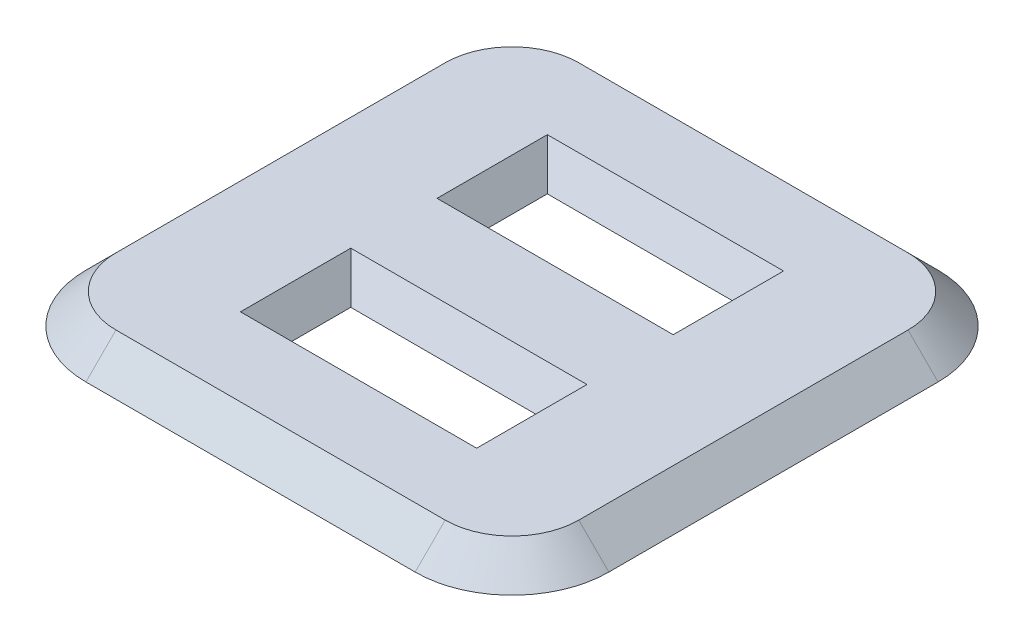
ISO-10303-21;
HEADER;
FILE_DESCRIPTION(('STEP AP214'),'2;1');
FILE_NAME('part.step','',(''),(''),'','','');
FILE_SCHEMA(('AUTOMOTIVE_DESIGN { 1 0 10303 214 1 1 1 1 }'));
ENDSEC;
DATA;
#1=APPLICATION_CONTEXT('core data for automotive mechanical design processes');
#2=APPLICATION_PROTOCOL_DEFINITION('international standard','automotive_design',2000,#1);
#3=PRODUCT_CONTEXT('',#1,'mechanical');
#4=PRODUCT('Part','Part','',(#3));
#5=PRODUCT_RELATED_PRODUCT_CATEGORY('part','',(#4));
#6=PRODUCT_DEFINITION_FORMATION('','',#4);
#7=PRODUCT_DEFINITION_CONTEXT('part definition',#1,'design');
#8=PRODUCT_DEFINITION('design','',#6,#7);
#9=PRODUCT_DEFINITION_SHAPE('','',#8);
#10=(LENGTH_UNIT() NAMED_UNIT(*) SI_UNIT(.MILLI.,.METRE.));
#11=(NAMED_UNIT(*) PLANE_ANGLE_UNIT() SI_UNIT($,.RADIAN.));
#12=(NAMED_UNIT(*) SI_UNIT($,.STERADIAN.) SOLID_ANGLE_UNIT());
#13=UNCERTAINTY_MEASURE_WITH_UNIT(LENGTH_MEASURE(1.E-05),#10,'distance_accuracy_value','');
#14=(GEOMETRIC_REPRESENTATION_CONTEXT(3) GLOBAL_UNCERTAINTY_ASSIGNED_CONTEXT((#13)) GLOBAL_UNIT_ASSIGNED_CONTEXT((#10,
#11,#12)) REPRESENTATION_CONTEXT('',''));
#15=CARTESIAN_POINT('',(0.,0.,0.));
#16=DIRECTION('',(0.,0.,1.));
#17=DIRECTION('',(1.,0.,0.));
#18=AXIS2_PLACEMENT_3D('',#15,#16,#17);
#19=CARTESIAN_POINT('',(0.,0.31,0.));
#20=DIRECTION('',(0.,-1.,0.));
#21=DIRECTION('',(0.,0.,-1.));
#22=AXIS2_PLACEMENT_3D('',#19,#20,#21);
#23=PLANE('',#22);
#24=DIRECTION('',(-1.,0.,0.));
#25=VECTOR('',#24,1.);
#26=CARTESIAN_POINT('',(0.,0.31,1.58449223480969));
#27=LINE('',#26,#25);
#28=CARTESIAN_POINT('',(1.21949223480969,0.31,1.58449223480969));
#29=VERTEX_POINT('',#28);
#30=CARTESIAN_POINT('',(-1.21949223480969,0.31,1.58449223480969));
#31=VERTEX_POINT('',#30);
#32=EDGE_CURVE('E49',#29,#31,#27,.T.);
#33=ORIENTED_EDGE('',*,*,#32,.T.);
#34=DIRECTION('',(0.,0.,-1.));
#35=VECTOR('',#34,1.);
#36=CARTESIAN_POINT('',(-1.21949223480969,0.31,0.));
#37=LINE('',#36,#35);
#38=CARTESIAN_POINT('',(-1.21949223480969,0.31,0.445507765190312));
#39=VERTEX_POINT('',#38);
#40=EDGE_CURVE('E11',#31,#39,#37,.T.);
#41=ORIENTED_EDGE('',*,*,#40,.T.);
#42=DIRECTION('',(1.,0.,0.));
#43=VECTOR('',#42,1.);
#44=CARTESIAN_POINT('',(0.,0.31,0.445507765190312));
#45=LINE('',#44,#43);
#46=CARTESIAN_POINT('',(1.21949223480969,0.31,0.445507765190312));
#47=VERTEX_POINT('',#46);
#48=EDGE_CURVE('E260',#39,#47,#45,.T.);
#49=ORIENTED_EDGE('',*,*,#48,.T.);
#50=DIRECTION('',(0.,0.,1.));
#51=VECTOR('',#50,1.);
#52=CARTESIAN_POINT('',(1.21949223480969,0.31,0.));
#53=LINE('',#52,#51);
#54=EDGE_CURVE('E60',#47,#29,#53,.T.);
#55=ORIENTED_EDGE('',*,*,#54,.T.);
#56=EDGE_LOOP('',(#33,#41,#49,#55));
#57=FACE_BOUND('',#56,.T.);
#58=DIRECTION('',(0.,0.,1.));
#59=VECTOR('',#58,1.);
#60=CARTESIAN_POINT('',(1.21949223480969,0.31,0.));
#61=LINE('',#60,#59);
#62=CARTESIAN_POINT('',(1.21949223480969,0.31,-1.58449223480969));
#63=VERTEX_POINT('',#62);
#64=CARTESIAN_POINT('',(1.21949223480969,0.31,-0.445507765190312));
#65=VERTEX_POINT('',#64);
#66=EDGE_CURVE('E256',#63,#65,#61,.T.);
#67=ORIENTED_EDGE('',*,*,#66,.T.);
#68=DIRECTION('',(-1.,0.,0.));
#69=VECTOR('',#68,1.);
#70=CARTESIAN_POINT('',(0.,0.31,-0.445507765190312));
#71=LINE('',#70,#69);
#72=CARTESIAN_POINT('',(-1.21949223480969,0.31,-0.445507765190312));
#73=VERTEX_POINT('',#72);
#74=EDGE_CURVE('E258',#65,#73,#71,.T.);
#75=ORIENTED_EDGE('',*,*,#74,.T.);
#76=DIRECTION('',(0.,0.,-1.));
#77=VECTOR('',#76,1.);
#78=CARTESIAN_POINT('',(-1.21949223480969,0.31,0.));
#79=LINE('',#78,#77);
#80=CARTESIAN_POINT('',(-1.21949223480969,0.31,-1.58449223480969));
#81=VERTEX_POINT('',#80);
#82=EDGE_CURVE('E169',#73,#81,#79,.T.);
#83=ORIENTED_EDGE('',*,*,#82,.T.);
#84=DIRECTION('',(1.,0.,0.));
#85=VECTOR('',#84,1.);
#86=CARTESIAN_POINT('',(0.,0.31,-1.58449223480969));
#87=LINE('',#86,#85);
#88=EDGE_CURVE('E233',#81,#63,#87,.T.);
#89=ORIENTED_EDGE('',*,*,#88,.T.);
#90=EDGE_LOOP('',(#67,#75,#83,#89));
#91=FACE_BOUND('',#90,.T.);
#92=DIRECTION('',(1.,0.,0.));
#93=VECTOR('',#92,1.);
#94=CARTESIAN_POINT('',(0.,0.31,2.39));
#95=LINE('',#94,#93);
#96=CARTESIAN_POINT('',(-1.7,0.31,2.39));
#97=VERTEX_POINT('',#96);
#98=CARTESIAN_POINT('',(1.7,0.31,2.39));
#99=VERTEX_POINT('',#98);
#100=EDGE_CURVE('E228',#97,#99,#95,.T.);
#101=ORIENTED_EDGE('',*,*,#100,.T.);
#102=CARTESIAN_POINT('',(1.7,0.31,1.7));
#103=DIRECTION('',(0.,-1.,0.));
#104=DIRECTION('',(0.,0.,-1.));
#105=AXIS2_PLACEMENT_3D('',#102,#103,#104);
#106=CIRCLE('',#105,0.69);
#107=CARTESIAN_POINT('',(2.39,0.31,1.7));
#108=VERTEX_POINT('',#107);
#109=EDGE_CURVE('E230',#99,#108,#106,.F.);
#110=ORIENTED_EDGE('',*,*,#109,.T.);
#111=DIRECTION('',(0.,0.,-1.));
#112=VECTOR('',#111,1.);
#113=CARTESIAN_POINT('',(2.39,0.31,0.));
#114=LINE('',#113,#112);
#115=CARTESIAN_POINT('',(2.39,0.31,-1.7));
#116=VERTEX_POINT('',#115);
#117=EDGE_CURVE('E216',#108,#116,#114,.T.);
#118=ORIENTED_EDGE('',*,*,#117,.T.);
#119=CARTESIAN_POINT('',(1.7,0.31,-1.7));
#120=DIRECTION('',(0.,-1.,0.));
#121=DIRECTION('',(0.,0.,-1.));
#122=AXIS2_PLACEMENT_3D('',#119,#120,#121);
#123=CIRCLE('',#122,0.69);
#124=CARTESIAN_POINT('',(1.7,0.31,-2.39));
#125=VERTEX_POINT('',#124);
#126=EDGE_CURVE('E218',#116,#125,#123,.F.);
#127=ORIENTED_EDGE('',*,*,#126,.T.);
#128=DIRECTION('',(-1.,0.,0.));
#129=VECTOR('',#128,1.);
#130=CARTESIAN_POINT('',(0.,0.31,-2.39));
#131=LINE('',#130,#129);
#132=CARTESIAN_POINT('',(-1.7,0.31,-2.39));
#133=VERTEX_POINT('',#132);
#134=EDGE_CURVE('E220',#125,#133,#131,.T.);
#135=ORIENTED_EDGE('',*,*,#134,.T.);
#136=CARTESIAN_POINT('',(-1.7,0.31,-1.7));
#137=DIRECTION('',(0.,-1.,0.));
#138=DIRECTION('',(0.,0.,-1.));
#139=AXIS2_PLACEMENT_3D('',#136,#137,#138);
#140=CIRCLE('',#139,0.69);
#141=CARTESIAN_POINT('',(-2.39,0.31,-1.7));
#142=VERTEX_POINT('',#141);
#143=EDGE_CURVE('E222',#133,#142,#140,.F.);
#144=ORIENTED_EDGE('',*,*,#143,.T.);
#145=DIRECTION('',(0.,0.,1.));
#146=VECTOR('',#145,1.);
#147=CARTESIAN_POINT('',(-2.39,0.31,0.));
#148=LINE('',#147,#146);
#149=CARTESIAN_POINT('',(-2.39,0.31,1.7));
#150=VERTEX_POINT('',#149);
#151=EDGE_CURVE('E224',#142,#150,#148,.T.);
#152=ORIENTED_EDGE('',*,*,#151,.T.);
#153=CARTESIAN_POINT('',(-1.7,0.31,1.7));
#154=DIRECTION('',(0.,-1.,0.));
#155=DIRECTION('',(0.,0.,-1.));
#156=AXIS2_PLACEMENT_3D('',#153,#154,#155);
#157=CIRCLE('',#156,0.69);
#158=EDGE_CURVE('E226',#150,#97,#157,.F.);
#159=ORIENTED_EDGE('',*,*,#158,.T.);
#160=EDGE_LOOP('',(#101,#110,#118,#127,#135,#144,#152,#159));
#161=FACE_BOUND('',#160,.T.);
#162=ADVANCED_FACE('F39',(#57,#91,#161),#23,.F.);
#163=CARTESIAN_POINT('',(0.,0.,0.));
#164=DIRECTION('',(0.,-1.,0.));
#165=DIRECTION('',(0.,0.,-1.));
#166=AXIS2_PLACEMENT_3D('',#163,#164,#165);
#167=PLANE('',#166);
#168=DIRECTION('',(0.,0.,1.));
#169=VECTOR('',#168,1.);
#170=CARTESIAN_POINT('',(-1.,0.,-1.365));
#171=LINE('',#170,#169);
#172=CARTESIAN_POINT('',(-1.,0.,-1.365));
#173=VERTEX_POINT('',#172);
#174=CARTESIAN_POINT('',(-1.,0.,-0.664999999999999));
#175=VERTEX_POINT('',#174);
#176=EDGE_CURVE('E153',#173,#175,#171,.T.);
#177=ORIENTED_EDGE('',*,*,#176,.T.);
#178=DIRECTION('',(1.,0.,0.));
#179=VECTOR('',#178,1.);
#180=CARTESIAN_POINT('',(1.,0.,-0.664999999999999));
#181=LINE('',#180,#179);
#182=CARTESIAN_POINT('',(1.,0.,-0.664999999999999));
#183=VERTEX_POINT('',#182);
#184=EDGE_CURVE('E158',#175,#183,#181,.T.);
#185=ORIENTED_EDGE('',*,*,#184,.T.);
#186=DIRECTION('',(0.,0.,-1.));
#187=VECTOR('',#186,1.);
#188=CARTESIAN_POINT('',(1.,0.,-1.365));
#189=LINE('',#188,#187);
#190=CARTESIAN_POINT('',(1.,0.,-1.365));
#191=VERTEX_POINT('',#190);
#192=EDGE_CURVE('E179',#183,#191,#189,.T.);
#193=ORIENTED_EDGE('',*,*,#192,.T.);
#194=DIRECTION('',(-1.,0.,0.));
#195=VECTOR('',#194,1.);
#196=CARTESIAN_POINT('',(1.,0.,-1.365));
#197=LINE('',#196,#195);
#198=EDGE_CURVE('E160',#191,#173,#197,.T.);
#199=ORIENTED_EDGE('',*,*,#198,.T.);
#200=EDGE_LOOP('',(#177,#185,#193,#199));
#201=FACE_BOUND('',#200,.T.);
#202=DIRECTION('',(0.,0.,-1.));
#203=VECTOR('',#202,1.);
#204=CARTESIAN_POINT('',(1.,0.,1.365));
#205=LINE('',#204,#203);
#206=CARTESIAN_POINT('',(1.,0.,1.365));
#207=VERTEX_POINT('',#206);
#208=CARTESIAN_POINT('',(1.,0.,0.664999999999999));
#209=VERTEX_POINT('',#208);
#210=EDGE_CURVE('E164',#207,#209,#205,.T.);
#211=ORIENTED_EDGE('',*,*,#210,.T.);
#212=DIRECTION('',(-1.,0.,0.));
#213=VECTOR('',#212,1.);
#214=CARTESIAN_POINT('',(1.,0.,0.664999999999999));
#215=LINE('',#214,#213);
#216=CARTESIAN_POINT('',(-1.,0.,0.664999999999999));
#217=VERTEX_POINT('',#216);
#218=EDGE_CURVE('E191',#209,#217,#215,.T.);
#219=ORIENTED_EDGE('',*,*,#218,.T.);
#220=DIRECTION('',(0.,0.,1.));
#221=VECTOR('',#220,1.);
#222=CARTESIAN_POINT('',(-1.,0.,1.365));
#223=LINE('',#222,#221);
#224=CARTESIAN_POINT('',(-1.,0.,1.365));
#225=VERTEX_POINT('',#224);
#226=EDGE_CURVE('E187',#217,#225,#223,.T.);
#227=ORIENTED_EDGE('',*,*,#226,.T.);
#228=DIRECTION('',(1.,0.,0.));
#229=VECTOR('',#228,1.);
#230=CARTESIAN_POINT('',(1.,0.,1.365));
#231=LINE('',#230,#229);
#232=EDGE_CURVE('E185',#225,#207,#231,.T.);
#233=ORIENTED_EDGE('',*,*,#232,.T.);
#234=EDGE_LOOP('',(#211,#219,#227,#233));
#235=FACE_BOUND('',#234,.T.);
#236=DIRECTION('',(0.,0.,1.));
#237=VECTOR('',#236,1.);
#238=CARTESIAN_POINT('',(-2.7,0.,-2.7));
#239=LINE('',#238,#237);
#240=CARTESIAN_POINT('',(-2.7,0.,-1.7));
#241=VERTEX_POINT('',#240);
#242=CARTESIAN_POINT('',(-2.7,0.,1.7));
#243=VERTEX_POINT('',#242);
#244=EDGE_CURVE('E194',#241,#243,#239,.T.);
#245=ORIENTED_EDGE('',*,*,#244,.F.);
#246=CARTESIAN_POINT('',(-1.7,0.,-1.7));
#247=DIRECTION('',(0.,-1.,0.));
#248=DIRECTION('',(0.,0.,-1.));
#249=AXIS2_PLACEMENT_3D('',#246,#247,#248);
#250=CIRCLE('',#249,1.);
#251=CARTESIAN_POINT('',(-1.7,0.,-2.7));
#252=VERTEX_POINT('',#251);
#253=EDGE_CURVE('E214',#241,#252,#250,.T.);
#254=ORIENTED_EDGE('',*,*,#253,.T.);
#255=DIRECTION('',(-1.,0.,0.));
#256=VECTOR('',#255,1.);
#257=CARTESIAN_POINT('',(2.7,0.,-2.7));
#258=LINE('',#257,#256);
#259=CARTESIAN_POINT('',(1.7,0.,-2.7));
#260=VERTEX_POINT('',#259);
#261=EDGE_CURVE('E204',#260,#252,#258,.T.);
#262=ORIENTED_EDGE('',*,*,#261,.F.);
#263=CARTESIAN_POINT('',(1.7,0.,-1.7));
#264=DIRECTION('',(0.,-1.,0.));
#265=DIRECTION('',(0.,0.,-1.));
#266=AXIS2_PLACEMENT_3D('',#263,#264,#265);
#267=CIRCLE('',#266,1.);
#268=CARTESIAN_POINT('',(2.7,0.,-1.7));
#269=VERTEX_POINT('',#268);
#270=EDGE_CURVE('E212',#260,#269,#267,.T.);
#271=ORIENTED_EDGE('',*,*,#270,.T.);
#272=DIRECTION('',(0.,0.,-1.));
#273=VECTOR('',#272,1.);
#274=CARTESIAN_POINT('',(2.7,0.,-2.7));
#275=LINE('',#274,#273);
#276=CARTESIAN_POINT('',(2.7,0.,1.7));
#277=VERTEX_POINT('',#276);
#278=EDGE_CURVE('E201',#277,#269,#275,.T.);
#279=ORIENTED_EDGE('',*,*,#278,.F.);
#280=CARTESIAN_POINT('',(1.7,0.,1.7));
#281=DIRECTION('',(0.,-1.,0.));
#282=DIRECTION('',(0.,0.,-1.));
#283=AXIS2_PLACEMENT_3D('',#280,#281,#282);
#284=CIRCLE('',#283,1.);
#285=CARTESIAN_POINT('',(1.7,0.,2.7));
#286=VERTEX_POINT('',#285);
#287=EDGE_CURVE('E209',#277,#286,#284,.T.);
#288=ORIENTED_EDGE('',*,*,#287,.T.);
#289=DIRECTION('',(1.,0.,0.));
#290=VECTOR('',#289,1.);
#291=CARTESIAN_POINT('',(2.7,0.,2.7));
#292=LINE('',#291,#290);
#293=CARTESIAN_POINT('',(-1.7,0.,2.7));
#294=VERTEX_POINT('',#293);
#295=EDGE_CURVE('E197',#294,#286,#292,.T.);
#296=ORIENTED_EDGE('',*,*,#295,.F.);
#297=CARTESIAN_POINT('',(-1.7,0.,1.7));
#298=DIRECTION('',(0.,-1.,0.));
#299=DIRECTION('',(0.,0.,-1.));
#300=AXIS2_PLACEMENT_3D('',#297,#298,#299);
#301=CIRCLE('',#300,1.);
#302=EDGE_CURVE('E207',#294,#243,#301,.T.);
#303=ORIENTED_EDGE('',*,*,#302,.T.);
#304=EDGE_LOOP('',(#245,#254,#262,#271,#279,#288,#296,#303));
#305=FACE_BOUND('',#304,.T.);
#306=ADVANCED_FACE('F155',(#201,#235,#305),#167,.T.);
#307=CARTESIAN_POINT('',(-1.7,0.31,-1.7));
#308=DIRECTION('',(0.,-1.,0.));
#309=DIRECTION('',(0.,0.,-1.));
#310=AXIS2_PLACEMENT_3D('',#307,#308,#309);
#311=CONICAL_SURFACE('',#310,0.69,0.785398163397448);
#312=DIRECTION('',(0.,0.707106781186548,0.707106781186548));
#313=VECTOR('',#312,1.);
#314=CARTESIAN_POINT('',(-1.7,0.,-2.7));
#315=LINE('',#314,#313);
#316=EDGE_CURVE('E249',#252,#133,#315,.T.);
#317=ORIENTED_EDGE('',*,*,#316,.F.);
#318=ORIENTED_EDGE('',*,*,#253,.F.);
#319=DIRECTION('',(-0.707106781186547,-0.707106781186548,0.));
#320=VECTOR('',#319,1.);
#321=CARTESIAN_POINT('',(-2.39,0.31,-1.7));
#322=LINE('',#321,#320);
#323=EDGE_CURVE('E198',#142,#241,#322,.T.);
#324=ORIENTED_EDGE('',*,*,#323,.F.);
#325=ORIENTED_EDGE('',*,*,#143,.F.);
#326=EDGE_LOOP('',(#317,#318,#324,#325));
#327=FACE_BOUND('',#326,.T.);
#328=ADVANCED_FACE('F295',(#327),#311,.T.);
#329=CARTESIAN_POINT('',(-2.39,0.31,0.));
#330=DIRECTION('',(0.707106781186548,-0.707106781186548,0.));
#331=DIRECTION('',(0.,0.,1.));
#332=AXIS2_PLACEMENT_3D('',#329,#330,#331);
#333=PLANE('',#332);
#334=ORIENTED_EDGE('',*,*,#323,.T.);
#335=ORIENTED_EDGE('',*,*,#244,.T.);
#336=DIRECTION('',(-0.707106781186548,-0.707106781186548,0.));
#337=VECTOR('',#336,1.);
#338=CARTESIAN_POINT('',(-2.39,0.31,1.7));
#339=LINE('',#338,#337);
#340=EDGE_CURVE('E246',#150,#243,#339,.T.);
#341=ORIENTED_EDGE('',*,*,#340,.F.);
#342=ORIENTED_EDGE('',*,*,#151,.F.);
#343=EDGE_LOOP('',(#334,#335,#341,#342));
#344=FACE_BOUND('',#343,.T.);
#345=ADVANCED_FACE('F342',(#344),#333,.F.);
#346=CARTESIAN_POINT('',(0.,0.31,-2.39));
#347=DIRECTION('',(0.,-0.707106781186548,0.707106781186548));
#348=DIRECTION('',(-1.,0.,0.));
#349=AXIS2_PLACEMENT_3D('',#346,#347,#348);
#350=PLANE('',#349);
#351=ORIENTED_EDGE('',*,*,#316,.T.);
#352=ORIENTED_EDGE('',*,*,#134,.F.);
#353=DIRECTION('',(0.,0.707106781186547,0.707106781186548));
#354=VECTOR('',#353,1.);
#355=CARTESIAN_POINT('',(1.7,0.,-2.7));
#356=LINE('',#355,#354);
#357=EDGE_CURVE('E243',#260,#125,#356,.T.);
#358=ORIENTED_EDGE('',*,*,#357,.F.);
#359=ORIENTED_EDGE('',*,*,#261,.T.);
#360=EDGE_LOOP('',(#351,#352,#358,#359));
#361=FACE_BOUND('',#360,.T.);
#362=ADVANCED_FACE('F335',(#361),#350,.F.);
#363=CARTESIAN_POINT('',(-1.7,0.31,1.7));
#364=DIRECTION('',(0.,-1.,0.));
#365=DIRECTION('',(0.,0.,-1.));
#366=AXIS2_PLACEMENT_3D('',#363,#364,#365);
#367=CONICAL_SURFACE('',#366,0.69,0.785398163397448);
#368=ORIENTED_EDGE('',*,*,#340,.T.);
#369=ORIENTED_EDGE('',*,*,#302,.F.);
#370=DIRECTION('',(0.,-0.707106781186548,0.707106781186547));
#371=VECTOR('',#370,1.);
#372=CARTESIAN_POINT('',(-1.7,0.31,2.39));
#373=LINE('',#372,#371);
#374=EDGE_CURVE('E240',#97,#294,#373,.T.);
#375=ORIENTED_EDGE('',*,*,#374,.F.);
#376=ORIENTED_EDGE('',*,*,#158,.F.);
#377=EDGE_LOOP('',(#368,#369,#375,#376));
#378=FACE_BOUND('',#377,.T.);
#379=ADVANCED_FACE('F328',(#378),#367,.T.);
#380=CARTESIAN_POINT('',(1.7,0.31,-1.7));
#381=DIRECTION('',(0.,-1.,0.));
#382=DIRECTION('',(0.,0.,-1.));
#383=AXIS2_PLACEMENT_3D('',#380,#381,#382);
#384=CONICAL_SURFACE('',#383,0.69,0.785398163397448);
#385=ORIENTED_EDGE('',*,*,#357,.T.);
#386=ORIENTED_EDGE('',*,*,#126,.F.);
#387=DIRECTION('',(-0.707106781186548,0.707106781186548,0.));
#388=VECTOR('',#387,1.);
#389=CARTESIAN_POINT('',(2.7,0.,-1.7));
#390=LINE('',#389,#388);
#391=EDGE_CURVE('E237',#269,#116,#390,.T.);
#392=ORIENTED_EDGE('',*,*,#391,.F.);
#393=ORIENTED_EDGE('',*,*,#270,.F.);
#394=EDGE_LOOP('',(#385,#386,#392,#393));
#395=FACE_BOUND('',#394,.T.);
#396=ADVANCED_FACE('F321',(#395),#384,.T.);
#397=CARTESIAN_POINT('',(0.,0.31,2.39));
#398=DIRECTION('',(0.,-0.707106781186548,-0.707106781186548));
#399=DIRECTION('',(1.,0.,0.));
#400=AXIS2_PLACEMENT_3D('',#397,#398,#399);
#401=PLANE('',#400);
#402=ORIENTED_EDGE('',*,*,#374,.T.);
#403=ORIENTED_EDGE('',*,*,#295,.T.);
#404=DIRECTION('',(0.,-0.707106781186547,0.707106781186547));
#405=VECTOR('',#404,1.);
#406=CARTESIAN_POINT('',(1.7,0.31,2.39));
#407=LINE('',#406,#405);
#408=EDGE_CURVE('E235',#99,#286,#407,.T.);
#409=ORIENTED_EDGE('',*,*,#408,.F.);
#410=ORIENTED_EDGE('',*,*,#100,.F.);
#411=EDGE_LOOP('',(#402,#403,#409,#410));
#412=FACE_BOUND('',#411,.T.);
#413=ADVANCED_FACE('F314',(#412),#401,.F.);
#414=CARTESIAN_POINT('',(2.39,0.31,0.));
#415=DIRECTION('',(-0.707106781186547,-0.707106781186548,0.));
#416=DIRECTION('',(0.,0.,-1.));
#417=AXIS2_PLACEMENT_3D('',#414,#415,#416);
#418=PLANE('',#417);
#419=ORIENTED_EDGE('',*,*,#391,.T.);
#420=ORIENTED_EDGE('',*,*,#117,.F.);
#421=DIRECTION('',(-0.707106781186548,0.707106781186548,0.));
#422=VECTOR('',#421,1.);
#423=CARTESIAN_POINT('',(2.7,0.,1.7));
#424=LINE('',#423,#422);
#425=EDGE_CURVE('E184',#277,#108,#424,.T.);
#426=ORIENTED_EDGE('',*,*,#425,.F.);
#427=ORIENTED_EDGE('',*,*,#278,.T.);
#428=EDGE_LOOP('',(#419,#420,#426,#427));
#429=FACE_BOUND('',#428,.T.);
#430=ADVANCED_FACE('F307',(#429),#418,.F.);
#431=CARTESIAN_POINT('',(1.7,0.31,1.7));
#432=DIRECTION('',(0.,-1.,0.));
#433=DIRECTION('',(0.,0.,-1.));
#434=AXIS2_PLACEMENT_3D('',#431,#432,#433);
#435=CONICAL_SURFACE('',#434,0.69,0.785398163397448);
#436=ORIENTED_EDGE('',*,*,#408,.T.);
#437=ORIENTED_EDGE('',*,*,#287,.F.);
#438=ORIENTED_EDGE('',*,*,#425,.T.);
#439=ORIENTED_EDGE('',*,*,#109,.F.);
#440=EDGE_LOOP('',(#436,#437,#438,#439));
#441=FACE_BOUND('',#440,.T.);
#442=ADVANCED_FACE('F299',(#441),#435,.T.);
#443=CARTESIAN_POINT('',(1.,0.,1.365));
#444=DIRECTION('',(0.81613759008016,-0.577857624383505,0.));
#445=DIRECTION('',(0.,0.,-1.));
#446=AXIS2_PLACEMENT_3D('',#443,#444,#445);
#447=PLANE('',#446);
#448=DIRECTION('',(0.500329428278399,0.7066405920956,0.500329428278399));
#449=VECTOR('',#448,1.);
#450=CARTESIAN_POINT('',(1.,0.,1.365));
#451=LINE('',#450,#449);
#452=EDGE_CURVE('E268',#29,#207,#451,.F.);
#453=ORIENTED_EDGE('',*,*,#452,.F.);
#454=ORIENTED_EDGE('',*,*,#54,.F.);
#455=DIRECTION('',(0.500329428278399,0.7066405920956,-0.500329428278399));
#456=VECTOR('',#455,1.);
#457=CARTESIAN_POINT('',(0.824769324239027,-0.247487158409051,0.840230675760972));
#458=LINE('',#457,#456);
#459=EDGE_CURVE('E188',#209,#47,#458,.T.);
#460=ORIENTED_EDGE('',*,*,#459,.F.);
#461=ORIENTED_EDGE('',*,*,#210,.F.);
#462=EDGE_LOOP('',(#453,#454,#460,#461));
#463=FACE_BOUND('',#462,.T.);
#464=ADVANCED_FACE('F306',(#463),#447,.F.);
#465=CARTESIAN_POINT('',(1.,0.,0.664999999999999));
#466=DIRECTION('',(0.,-0.577857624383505,-0.81613759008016));
#467=DIRECTION('',(-1.,0.,0.));
#468=AXIS2_PLACEMENT_3D('',#465,#466,#467);
#469=PLANE('',#468);
#470=ORIENTED_EDGE('',*,*,#459,.T.);
#471=ORIENTED_EDGE('',*,*,#48,.F.);
#472=DIRECTION('',(0.500329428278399,-0.7066405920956,0.500329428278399));
#473=VECTOR('',#472,1.);
#474=CARTESIAN_POINT('',(-0.824769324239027,-0.247487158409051,0.840230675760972));
#475=LINE('',#474,#473);
#476=EDGE_CURVE('E266',#217,#39,#475,.F.);
#477=ORIENTED_EDGE('',*,*,#476,.F.);
#478=ORIENTED_EDGE('',*,*,#218,.F.);
#479=EDGE_LOOP('',(#470,#471,#477,#478));
#480=FACE_BOUND('',#479,.T.);
#481=ADVANCED_FACE('F369',(#480),#469,.F.);
#482=CARTESIAN_POINT('',(1.,0.,1.365));
#483=DIRECTION('',(0.,-0.577857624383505,0.81613759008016));
#484=DIRECTION('',(1.,0.,0.));
#485=AXIS2_PLACEMENT_3D('',#482,#483,#484);
#486=PLANE('',#485);
#487=ORIENTED_EDGE('',*,*,#452,.T.);
#488=ORIENTED_EDGE('',*,*,#232,.F.);
#489=DIRECTION('',(-0.500329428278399,0.7066405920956,0.500329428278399));
#490=VECTOR('',#489,1.);
#491=CARTESIAN_POINT('',(-1.,0.,1.365));
#492=LINE('',#491,#490);
#493=EDGE_CURVE('E264',#31,#225,#492,.F.);
#494=ORIENTED_EDGE('',*,*,#493,.F.);
#495=ORIENTED_EDGE('',*,*,#32,.F.);
#496=EDGE_LOOP('',(#487,#488,#494,#495));
#497=FACE_BOUND('',#496,.T.);
#498=ADVANCED_FACE('F362',(#497),#486,.F.);
#499=CARTESIAN_POINT('',(-1.,0.,1.365));
#500=DIRECTION('',(-0.81613759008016,-0.577857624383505,0.));
#501=DIRECTION('',(0.,0.,1.));
#502=AXIS2_PLACEMENT_3D('',#499,#500,#501);
#503=PLANE('',#502);
#504=ORIENTED_EDGE('',*,*,#476,.T.);
#505=ORIENTED_EDGE('',*,*,#40,.F.);
#506=ORIENTED_EDGE('',*,*,#493,.T.);
#507=ORIENTED_EDGE('',*,*,#226,.F.);
#508=EDGE_LOOP('',(#504,#505,#506,#507));
#509=FACE_BOUND('',#508,.T.);
#510=ADVANCED_FACE('F356',(#509),#503,.F.);
#511=CARTESIAN_POINT('',(1.,0.,-1.365));
#512=DIRECTION('',(0.,-0.577857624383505,-0.81613759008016));
#513=DIRECTION('',(-1.,0.,0.));
#514=AXIS2_PLACEMENT_3D('',#511,#512,#513);
#515=PLANE('',#514);
#516=DIRECTION('',(0.500329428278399,0.7066405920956,-0.500329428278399));
#517=VECTOR('',#516,1.);
#518=CARTESIAN_POINT('',(1.,0.,-1.365));
#519=LINE('',#518,#517);
#520=EDGE_CURVE('E173',#63,#191,#519,.F.);
#521=ORIENTED_EDGE('',*,*,#520,.F.);
#522=ORIENTED_EDGE('',*,*,#88,.F.);
#523=DIRECTION('',(0.500329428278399,-0.7066405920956,0.500329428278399));
#524=VECTOR('',#523,1.);
#525=CARTESIAN_POINT('',(-1.,0.,-1.365));
#526=LINE('',#525,#524);
#527=EDGE_CURVE('E44',#173,#81,#526,.F.);
#528=ORIENTED_EDGE('',*,*,#527,.F.);
#529=ORIENTED_EDGE('',*,*,#198,.F.);
#530=EDGE_LOOP('',(#521,#522,#528,#529));
#531=FACE_BOUND('',#530,.T.);
#532=ADVANCED_FACE('F42',(#531),#515,.F.);
#533=CARTESIAN_POINT('',(-1.,0.,-1.365));
#534=DIRECTION('',(-0.81613759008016,-0.577857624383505,0.));
#535=DIRECTION('',(0.,0.,1.));
#536=AXIS2_PLACEMENT_3D('',#533,#534,#535);
#537=PLANE('',#536);
#538=ORIENTED_EDGE('',*,*,#527,.T.);
#539=ORIENTED_EDGE('',*,*,#82,.F.);
#540=DIRECTION('',(0.500329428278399,-0.7066405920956,-0.500329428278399));
#541=VECTOR('',#540,1.);
#542=CARTESIAN_POINT('',(-0.49934092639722,-0.707106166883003,-1.16565907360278));
#543=LINE('',#542,#541);
#544=EDGE_CURVE('E167',#175,#73,#543,.F.);
#545=ORIENTED_EDGE('',*,*,#544,.F.);
#546=ORIENTED_EDGE('',*,*,#176,.F.);
#547=EDGE_LOOP('',(#538,#539,#545,#546));
#548=FACE_BOUND('',#547,.T.);
#549=ADVANCED_FACE('F168',(#548),#537,.F.);
#550=CARTESIAN_POINT('',(1.,0.,-1.365));
#551=DIRECTION('',(0.81613759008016,-0.577857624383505,0.));
#552=DIRECTION('',(0.,0.,-1.));
#553=AXIS2_PLACEMENT_3D('',#550,#551,#552);
#554=PLANE('',#553);
#555=ORIENTED_EDGE('',*,*,#520,.T.);
#556=ORIENTED_EDGE('',*,*,#192,.F.);
#557=DIRECTION('',(0.500329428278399,0.7066405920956,0.500329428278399));
#558=VECTOR('',#557,1.);
#559=CARTESIAN_POINT('',(1.,0.,-0.664999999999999));
#560=LINE('',#559,#558);
#561=EDGE_CURVE('E174',#65,#183,#560,.F.);
#562=ORIENTED_EDGE('',*,*,#561,.F.);
#563=ORIENTED_EDGE('',*,*,#66,.F.);
#564=EDGE_LOOP('',(#555,#556,#562,#563));
#565=FACE_BOUND('',#564,.T.);
#566=ADVANCED_FACE('F281',(#565),#554,.F.);
#567=CARTESIAN_POINT('',(1.,0.,-0.664999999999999));
#568=DIRECTION('',(0.,-0.577857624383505,0.81613759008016));
#569=DIRECTION('',(1.,0.,0.));
#570=AXIS2_PLACEMENT_3D('',#567,#568,#569);
#571=PLANE('',#570);
#572=ORIENTED_EDGE('',*,*,#544,.T.);
#573=ORIENTED_EDGE('',*,*,#74,.F.);
#574=ORIENTED_EDGE('',*,*,#561,.T.);
#575=ORIENTED_EDGE('',*,*,#184,.F.);
#576=EDGE_LOOP('',(#572,#573,#574,#575));
#577=FACE_BOUND('',#576,.T.);
#578=ADVANCED_FACE('F176',(#577),#571,.F.);
#579=CLOSED_SHELL('',(#162,#306,#328,#345,#362,#379,#396,#413,#430,#442,#464,#481,#498,#510,
#532,#549,#566,#578));
#580=MANIFOLD_SOLID_BREP('B2',#579);
#581=ADVANCED_BREP_SHAPE_REPRESENTATION('',(#18,#580),#14);
#582=SHAPE_DEFINITION_REPRESENTATION(#9,#581);
ENDSEC;
END-ISO-10303-21;
